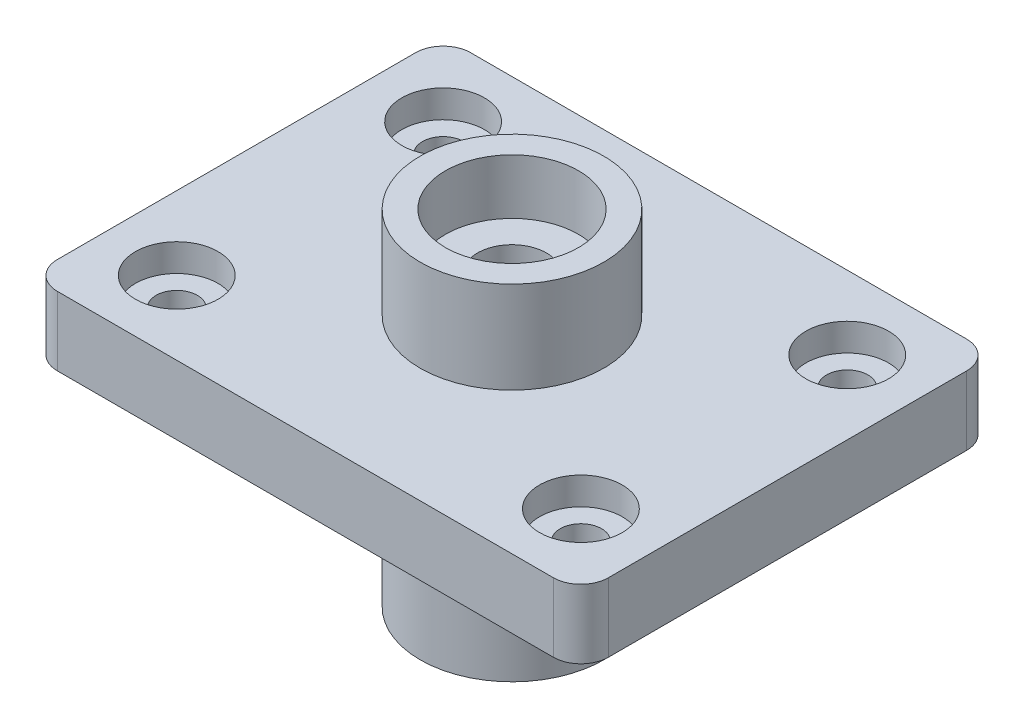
from build123d import *

# Parameters (mm, degrees)
SKETCH1_W                               = 240
SKETCH1_H                               = 180
EXTRUDE1_DEPTH                          = 30
SKETCH2_R                               = 40
EXTRUDE2_DEPTH                          = 150
CBORE_FOR_M5_HEX_HEAD_BOLT2_D           = 30
CBORE_FOR_M5_HEX_HEAD_BOLT2_CBORE_D     = 58
CBORE_FOR_M5_HEX_HEAD_BOLT2_CBORE_DEPTH = 24
SKETCH8_R                               = 23
CUT_EXTRUDE1_DEPTH                      = 12
CBORE_FOR_M5_HEX_HEAD_BOLT3_D           = 18
CBORE_FOR_M5_HEX_HEAD_BOLT3_CBORE_D     = 36
CBORE_FOR_M5_HEX_HEAD_BOLT3_CBORE_DEPTH = 12
LPATTERN1_COUNT                         = 2
LPATTERN1_PITCH                         = 116
LPATTERN1_COUNT_DIR2                    = 2
LPATTERN1_PITCH_DIR2                    = 176
FILLET1_R                               = 12


with BuildPart() as part:
    # Sketch1 → Extrude1 (new body)
    with BuildSketch(Plane(origin=(0, 0, 0), x_dir=(1, 0, 0), z_dir=(0, 1, 0))):
        Rectangle(SKETCH1_W, SKETCH1_H)
    extrude(amount=-EXTRUDE1_DEPTH)

    # Sketch2 → Extrude2 (add)
    with BuildSketch(Plane(origin=(0, 40, 0), x_dir=(-1, 0, 0), z_dir=(0, 1, 0))):
        with Locations(Location((0, 0, 0), (0, 0, 90))):
            Circle(SKETCH2_R)
    extrude(amount=-EXTRUDE2_DEPTH)

    # CBORE for M5 Hex Head Bolt2 (through all)
    with Locations(Plane.ZX.offset(40)):
        with Locations((0, 0)):
            CounterBoreHole(CBORE_FOR_M5_HEX_HEAD_BOLT2_D / 2, CBORE_FOR_M5_HEX_HEAD_BOLT2_CBORE_D / 2, CBORE_FOR_M5_HEX_HEAD_BOLT2_CBORE_DEPTH)

    # Sketch8 → Cut-Extrude1 (cut)
    with BuildSketch(Plane(origin=(0, -98, 0), x_dir=(-1, 0, 0), z_dir=(0, 1, 0))):
        with Locations(Location((0, 0, 0), (0, 0, 90))):
            Circle(SKETCH8_R)
    extrude(amount=CUT_EXTRUDE1_DEPTH, mode=Mode.SUBTRACT)

    # CBORE for M5 Hex Head Bolt3 (through all)
    with Locations(Plane(origin=(-88, 0, -58), x_dir=(0, 0, 1), z_dir=(0, 1, 0))):
        with Locations((0, 0)):
            cbore_for_m5_hex_head_bolt3 = CounterBoreHole(CBORE_FOR_M5_HEX_HEAD_BOLT3_D / 2, CBORE_FOR_M5_HEX_HEAD_BOLT3_CBORE_D / 2, CBORE_FOR_M5_HEX_HEAD_BOLT3_CBORE_DEPTH)

    # LPattern1: CBORE for M5 Hex Head Bolt3 2 × 2
    with Locations(*[(j * LPATTERN1_PITCH_DIR2, 0, i * LPATTERN1_PITCH) for i in range(LPATTERN1_COUNT) for j in range(LPATTERN1_COUNT_DIR2) if (i, j) != (0, 0)]):
        add(cbore_for_m5_hex_head_bolt3, mode=Mode.SUBTRACT)

    # Fillet1
    fillet1_edges = [part.edges().sort_by_distance(p)[0] for p in [
        (-120, -15, -90),
        (120, -15, -90),
        (120, -15, 90),
        (-120, -15, 90),
    ]]
    fillet(fillet1_edges, radius=FILLET1_R)


solid = part.part
